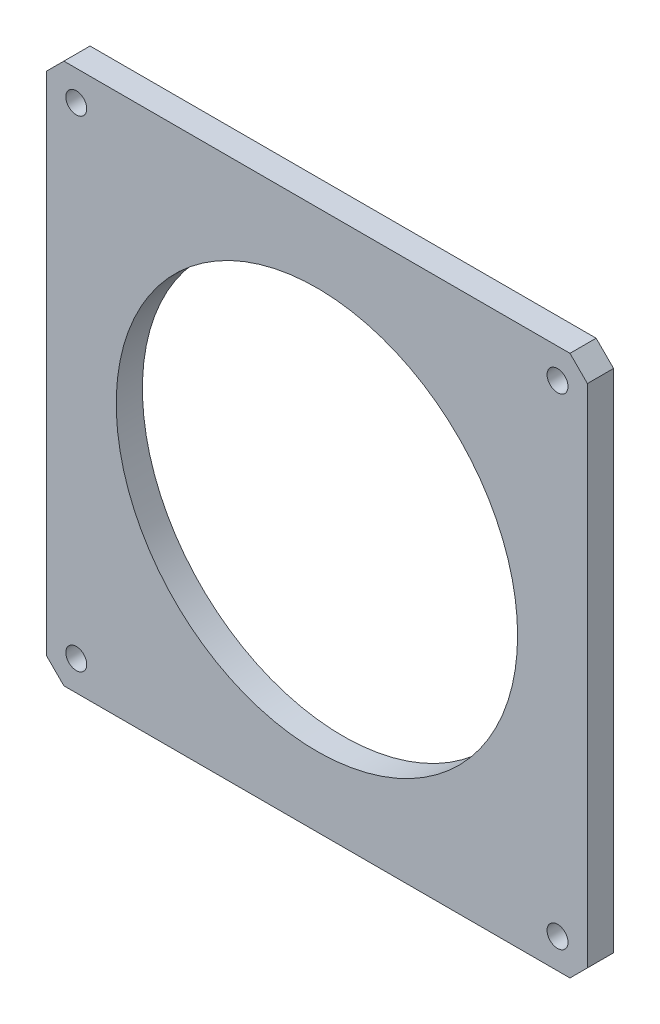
from build123d import *

# Parameters (mm, degrees)
ESQUISSE1_R        = 12
ESQUISSE1_R_2      = 230
BOSS_EXTRU_1_DEPTH = 30


with BuildPart() as part:
    # Esquisse1 → Boss.-Extru.1 (new body)
    with BuildSketch(Plane.XY):
        Polygon((-310, 290), (-290, 310), (290, 310), (310, 290), (310, -290), (290, -310), (-290, -310), (-310, -290), align=None)
        with Locations((-275.771644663, 275.771644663)):
            Circle(ESQUISSE1_R, mode=Mode.SUBTRACT)
        with Locations((275.771644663, 275.771644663)):
            Circle(ESQUISSE1_R, mode=Mode.SUBTRACT)
        with Locations((-275.771644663, -275.771644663)):
            Circle(ESQUISSE1_R, mode=Mode.SUBTRACT)
        with Locations((275.771644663, -275.771644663)):
            Circle(ESQUISSE1_R, mode=Mode.SUBTRACT)
        Circle(ESQUISSE1_R_2, mode=Mode.SUBTRACT)
    extrude(amount=BOSS_EXTRU_1_DEPTH)


solid = part.part
